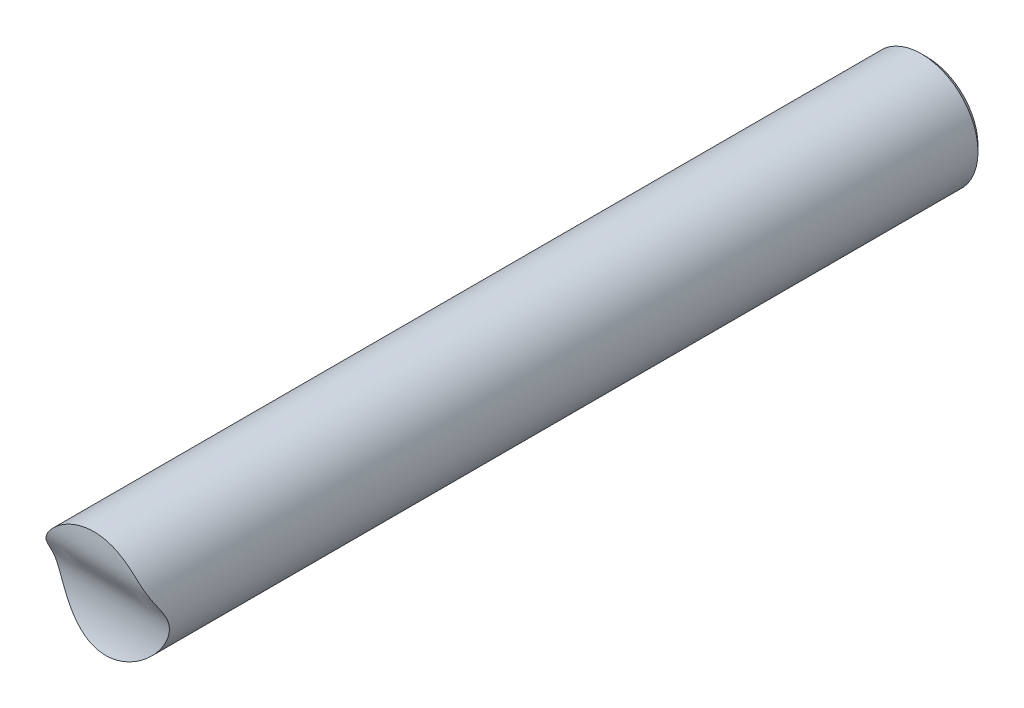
from build123d import *

# Parameters (mm, degrees)
ESQUISSE1_R                  = 20
EXTRUSION1_DEPTH             = 300
CHANFREIN1_SIZE              = 2
ENL_V_MAT_EXTRU_1_DEPTH      = 302.330383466
ENL_V_MAT_EXTRU_1_DEPTH_BACK = 302.330383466


with BuildPart() as part:
    # Esquisse1 → Extrusion1 (new body)
    with BuildSketch(Plane.XY):
        Circle(ESQUISSE1_R)
    extrude(amount=EXTRUSION1_DEPTH)

    # Chanfrein1
    chanfrein1_edges = [part.edges().sort_by_distance(p)[0] for p in [
        (-20, 0, 0),
    ]]
    chamfer(chanfrein1_edges, length=CHANFREIN1_SIZE)

    # Esquisse4 → Enl_v. mat.-Extru.1 (cut, two sides: drawn at the far end of the back side and taken through both)
    with BuildSketch(Plane(origin=(0, 0, 0), x_dir=(0, 0, -1), z_dir=(1, 0, 0)).offset(-ENL_V_MAT_EXTRU_1_DEPTH_BACK)):
        with BuildLine():
            add(Edge.make_bspline(
                [(-293.967297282, 29.647301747), (-292.746432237, 26.565672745), (-297.425889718, 11.438390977), (-286.540327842, 0.318913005), (-286.666001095, -14.460277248), (-299.166156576, -38.966728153), (-333.058026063, 0.776097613), (-296.453422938, 35.922620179), (-293.967297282, 29.647301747)],
                knots=[0, 0, 0, 0, 0.138574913, 0.232331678, 0.333660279, 0.45983651, 0.717811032, 1, 1, 1, 1], degree=3))
        make_face()
    extrude(amount=ENL_V_MAT_EXTRU_1_DEPTH + ENL_V_MAT_EXTRU_1_DEPTH_BACK, mode=Mode.SUBTRACT)


solid = part.part
